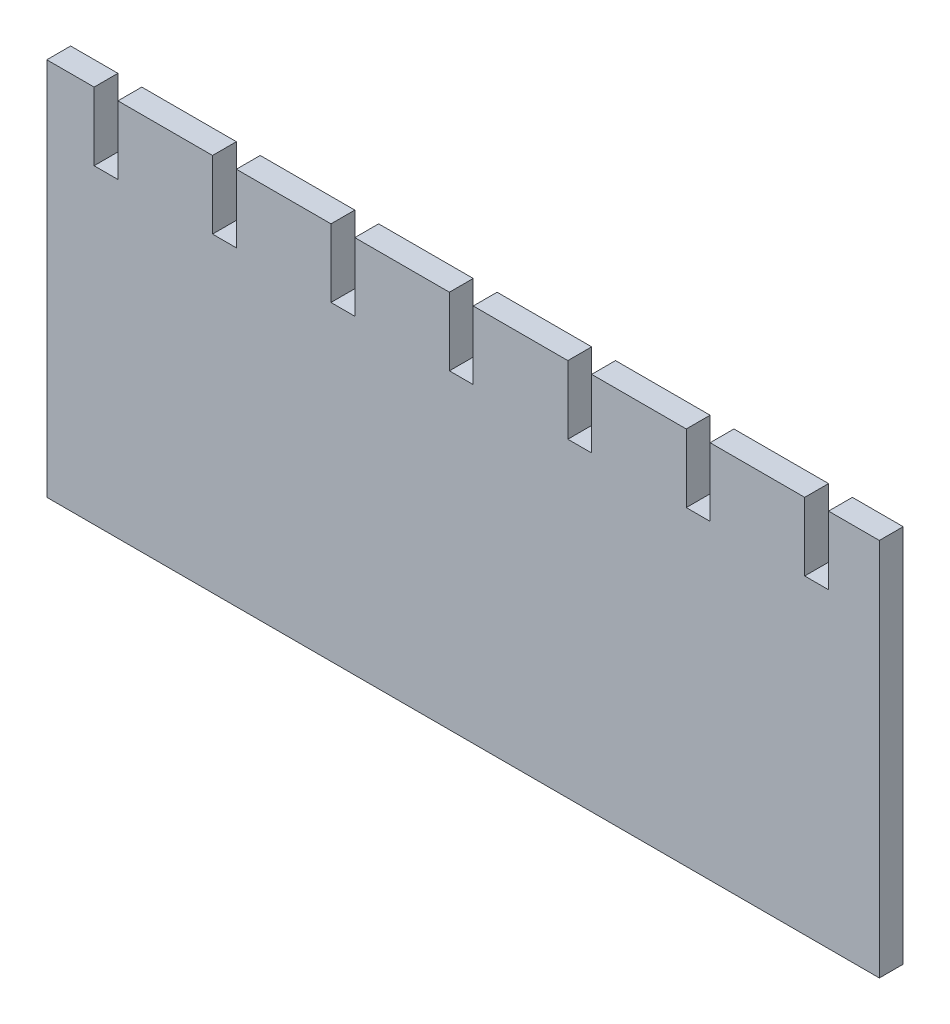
ISO-10303-21;
HEADER;
FILE_DESCRIPTION(('STEP AP214'),'2;1');
FILE_NAME('part.step','',(''),(''),'','','');
FILE_SCHEMA(('AUTOMOTIVE_DESIGN { 1 0 10303 214 1 1 1 1 }'));
ENDSEC;
DATA;
#1=APPLICATION_CONTEXT('core data for automotive mechanical design processes');
#2=APPLICATION_PROTOCOL_DEFINITION('international standard','automotive_design',2000,#1);
#3=PRODUCT_CONTEXT('',#1,'mechanical');
#4=PRODUCT('Part','Part','',(#3));
#5=PRODUCT_RELATED_PRODUCT_CATEGORY('part','',(#4));
#6=PRODUCT_DEFINITION_FORMATION('','',#4);
#7=PRODUCT_DEFINITION_CONTEXT('part definition',#1,'design');
#8=PRODUCT_DEFINITION('design','',#6,#7);
#9=PRODUCT_DEFINITION_SHAPE('','',#8);
#10=(LENGTH_UNIT() NAMED_UNIT(*) SI_UNIT(.MILLI.,.METRE.));
#11=(NAMED_UNIT(*) PLANE_ANGLE_UNIT() SI_UNIT($,.RADIAN.));
#12=(NAMED_UNIT(*) SI_UNIT($,.STERADIAN.) SOLID_ANGLE_UNIT());
#13=UNCERTAINTY_MEASURE_WITH_UNIT(LENGTH_MEASURE(1.E-05),#10,'distance_accuracy_value','');
#14=(GEOMETRIC_REPRESENTATION_CONTEXT(3) GLOBAL_UNCERTAINTY_ASSIGNED_CONTEXT((#13)) GLOBAL_UNIT_ASSIGNED_CONTEXT((#10,
#11,#12)) REPRESENTATION_CONTEXT('',''));
#15=CARTESIAN_POINT('',(0.,0.,0.));
#16=DIRECTION('',(0.,0.,1.));
#17=DIRECTION('',(1.,0.,0.));
#18=AXIS2_PLACEMENT_3D('',#15,#16,#17);
#19=CARTESIAN_POINT('',(-228.601896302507,165.29206567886,16.002));
#20=DIRECTION('',(0.,-1.,0.));
#21=DIRECTION('',(0.,0.,-1.));
#22=AXIS2_PLACEMENT_3D('',#19,#20,#21);
#23=PLANE('',#22);
#24=DIRECTION('',(-1.,0.,0.));
#25=VECTOR('',#24,1.);
#26=CARTESIAN_POINT('',(-228.601896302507,165.29206567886,0.));
#27=LINE('',#26,#25);
#28=CARTESIAN_POINT('',(-228.601896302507,165.29206567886,0.));
#29=VERTEX_POINT('',#28);
#30=CARTESIAN_POINT('',(-260.351896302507,165.29206567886,0.));
#31=VERTEX_POINT('',#30);
#32=EDGE_CURVE('E273',#29,#31,#27,.T.);
#33=ORIENTED_EDGE('',*,*,#32,.T.);
#34=DIRECTION('',(0.,0.,-1.));
#35=VECTOR('',#34,1.);
#36=CARTESIAN_POINT('',(-260.351896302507,165.29206567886,16.002));
#37=LINE('',#36,#35);
#38=CARTESIAN_POINT('',(-260.351896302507,165.29206567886,16.002));
#39=VERTEX_POINT('',#38);
#40=EDGE_CURVE('E11',#39,#31,#37,.T.);
#41=ORIENTED_EDGE('',*,*,#40,.F.);
#42=DIRECTION('',(-1.,0.,0.));
#43=VECTOR('',#42,1.);
#44=CARTESIAN_POINT('',(-228.601896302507,165.29206567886,16.002));
#45=LINE('',#44,#43);
#46=CARTESIAN_POINT('',(-228.601896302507,165.29206567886,16.002));
#47=VERTEX_POINT('',#46);
#48=EDGE_CURVE('E335',#47,#39,#45,.T.);
#49=ORIENTED_EDGE('',*,*,#48,.F.);
#50=DIRECTION('',(0.,0.,-1.));
#51=VECTOR('',#50,1.);
#52=CARTESIAN_POINT('',(-228.601896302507,165.29206567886,16.002));
#53=LINE('',#52,#51);
#54=EDGE_CURVE('E269',#47,#29,#53,.T.);
#55=ORIENTED_EDGE('',*,*,#54,.T.);
#56=EDGE_LOOP('',(#33,#41,#49,#55));
#57=FACE_BOUND('',#56,.T.);
#58=ADVANCED_FACE('F33',(#57),#23,.F.);
#59=CARTESIAN_POINT('',(-260.351896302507,-89.0805979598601,16.002));
#60=DIRECTION('',(1.,0.,0.));
#61=DIRECTION('',(0.,0.,-1.));
#62=AXIS2_PLACEMENT_3D('',#59,#60,#61);
#63=PLANE('',#62);
#64=DIRECTION('',(0.,-1.,0.));
#65=VECTOR('',#64,1.);
#66=CARTESIAN_POINT('',(-260.351896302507,-89.0805979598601,0.));
#67=LINE('',#66,#65);
#68=CARTESIAN_POINT('',(-260.351896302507,-89.0805979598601,0.));
#69=VERTEX_POINT('',#68);
#70=EDGE_CURVE('E276',#31,#69,#67,.T.);
#71=ORIENTED_EDGE('',*,*,#70,.T.);
#72=DIRECTION('',(0.,0.,-1.));
#73=VECTOR('',#72,1.);
#74=CARTESIAN_POINT('',(-260.351896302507,-89.0805979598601,16.002));
#75=LINE('',#74,#73);
#76=CARTESIAN_POINT('',(-260.351896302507,-89.0805979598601,16.002));
#77=VERTEX_POINT('',#76);
#78=EDGE_CURVE('E41',#77,#69,#75,.T.);
#79=ORIENTED_EDGE('',*,*,#78,.F.);
#80=DIRECTION('',(0.,-1.,0.));
#81=VECTOR('',#80,1.);
#82=CARTESIAN_POINT('',(-260.351896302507,-89.0805979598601,16.002));
#83=LINE('',#82,#81);
#84=EDGE_CURVE('E164',#39,#77,#83,.T.);
#85=ORIENTED_EDGE('',*,*,#84,.F.);
#86=ORIENTED_EDGE('',*,*,#40,.T.);
#87=EDGE_LOOP('',(#71,#79,#85,#86));
#88=FACE_BOUND('',#87,.T.);
#89=ADVANCED_FACE('F513',(#88),#63,.F.);
#90=CARTESIAN_POINT('',(-260.351896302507,-89.0805979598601,16.002));
#91=DIRECTION('',(0.,1.,0.));
#92=DIRECTION('',(0.,0.,1.));
#93=AXIS2_PLACEMENT_3D('',#90,#91,#92);
#94=PLANE('',#93);
#95=DIRECTION('',(1.,0.,0.));
#96=VECTOR('',#95,1.);
#97=CARTESIAN_POINT('',(-260.351896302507,-89.0805979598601,0.));
#98=LINE('',#97,#96);
#99=CARTESIAN_POINT('',(298.517953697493,-89.0805979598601,0.));
#100=VERTEX_POINT('',#99);
#101=EDGE_CURVE('E278',#69,#100,#98,.T.);
#102=ORIENTED_EDGE('',*,*,#101,.T.);
#103=DIRECTION('',(0.,0.,-1.));
#104=VECTOR('',#103,1.);
#105=CARTESIAN_POINT('',(298.517953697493,-89.0805979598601,16.002));
#106=LINE('',#105,#104);
#107=CARTESIAN_POINT('',(298.517953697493,-89.0805979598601,16.002));
#108=VERTEX_POINT('',#107);
#109=EDGE_CURVE('E414',#108,#100,#106,.T.);
#110=ORIENTED_EDGE('',*,*,#109,.F.);
#111=DIRECTION('',(1.,0.,0.));
#112=VECTOR('',#111,1.);
#113=CARTESIAN_POINT('',(-260.351896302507,-89.0805979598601,16.002));
#114=LINE('',#113,#112);
#115=EDGE_CURVE('E422',#77,#108,#114,.T.);
#116=ORIENTED_EDGE('',*,*,#115,.F.);
#117=ORIENTED_EDGE('',*,*,#78,.T.);
#118=EDGE_LOOP('',(#102,#110,#116,#117));
#119=FACE_BOUND('',#118,.T.);
#120=ADVANCED_FACE('F420',(#119),#94,.F.);
#121=CARTESIAN_POINT('',(298.517953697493,-89.0805979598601,16.002));
#122=DIRECTION('',(-1.,0.,0.));
#123=DIRECTION('',(0.,0.,1.));
#124=AXIS2_PLACEMENT_3D('',#121,#122,#123);
#125=PLANE('',#124);
#126=DIRECTION('',(0.,1.,0.));
#127=VECTOR('',#126,1.);
#128=CARTESIAN_POINT('',(298.517953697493,-89.0805979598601,0.));
#129=LINE('',#128,#127);
#130=CARTESIAN_POINT('',(298.517953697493,165.29206567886,0.));
#131=VERTEX_POINT('',#130);
#132=EDGE_CURVE('E280',#100,#131,#129,.T.);
#133=ORIENTED_EDGE('',*,*,#132,.T.);
#134=DIRECTION('',(0.,0.,-1.));
#135=VECTOR('',#134,1.);
#136=CARTESIAN_POINT('',(298.517953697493,165.29206567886,16.002));
#137=LINE('',#136,#135);
#138=CARTESIAN_POINT('',(298.517953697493,165.29206567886,16.002));
#139=VERTEX_POINT('',#138);
#140=EDGE_CURVE('E411',#139,#131,#137,.T.);
#141=ORIENTED_EDGE('',*,*,#140,.F.);
#142=DIRECTION('',(0.,1.,0.));
#143=VECTOR('',#142,1.);
#144=CARTESIAN_POINT('',(298.517953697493,-89.0805979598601,16.002));
#145=LINE('',#144,#143);
#146=EDGE_CURVE('E440',#108,#139,#145,.T.);
#147=ORIENTED_EDGE('',*,*,#146,.F.);
#148=ORIENTED_EDGE('',*,*,#109,.T.);
#149=EDGE_LOOP('',(#133,#141,#147,#148));
#150=FACE_BOUND('',#149,.T.);
#151=ADVANCED_FACE('F431',(#150),#125,.F.);
#152=CARTESIAN_POINT('',(264.406083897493,165.29206567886,16.002));
#153=DIRECTION('',(0.,-1.,0.));
#154=DIRECTION('',(1.,0.,0.));
#155=AXIS2_PLACEMENT_3D('',#152,#153,#154);
#156=PLANE('',#155);
#157=DIRECTION('',(-1.,0.,0.));
#158=VECTOR('',#157,1.);
#159=CARTESIAN_POINT('',(264.406083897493,165.29206567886,0.));
#160=LINE('',#159,#158);
#161=CARTESIAN_POINT('',(264.406083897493,165.29206567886,0.));
#162=VERTEX_POINT('',#161);
#163=EDGE_CURVE('E282',#131,#162,#160,.T.);
#164=ORIENTED_EDGE('',*,*,#163,.T.);
#165=DIRECTION('',(0.,0.,-1.));
#166=VECTOR('',#165,1.);
#167=CARTESIAN_POINT('',(264.406083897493,165.29206567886,16.002));
#168=LINE('',#167,#166);
#169=CARTESIAN_POINT('',(264.406083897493,165.29206567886,16.002));
#170=VERTEX_POINT('',#169);
#171=EDGE_CURVE('E408',#170,#162,#168,.T.);
#172=ORIENTED_EDGE('',*,*,#171,.F.);
#173=DIRECTION('',(-1.,0.,0.));
#174=VECTOR('',#173,1.);
#175=CARTESIAN_POINT('',(264.406083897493,165.29206567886,16.002));
#176=LINE('',#175,#174);
#177=EDGE_CURVE('E437',#139,#170,#176,.T.);
#178=ORIENTED_EDGE('',*,*,#177,.F.);
#179=ORIENTED_EDGE('',*,*,#140,.T.);
#180=EDGE_LOOP('',(#164,#172,#178,#179));
#181=FACE_BOUND('',#180,.T.);
#182=ADVANCED_FACE('F435',(#181),#156,.F.);
#183=CARTESIAN_POINT('',(264.406083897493,119.57208453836,16.002));
#184=DIRECTION('',(1.,0.,0.));
#185=DIRECTION('',(0.,0.,-1.));
#186=AXIS2_PLACEMENT_3D('',#183,#184,#185);
#187=PLANE('',#186);
#188=DIRECTION('',(0.,-1.,0.));
#189=VECTOR('',#188,1.);
#190=CARTESIAN_POINT('',(264.406083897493,119.57208453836,0.));
#191=LINE('',#190,#189);
#192=CARTESIAN_POINT('',(264.406083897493,119.57208453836,0.));
#193=VERTEX_POINT('',#192);
#194=EDGE_CURVE('E284',#162,#193,#191,.T.);
#195=ORIENTED_EDGE('',*,*,#194,.T.);
#196=DIRECTION('',(0.,0.,-1.));
#197=VECTOR('',#196,1.);
#198=CARTESIAN_POINT('',(264.406083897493,119.57208453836,16.002));
#199=LINE('',#198,#197);
#200=CARTESIAN_POINT('',(264.406083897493,119.57208453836,16.002));
#201=VERTEX_POINT('',#200);
#202=EDGE_CURVE('E405',#201,#193,#199,.T.);
#203=ORIENTED_EDGE('',*,*,#202,.F.);
#204=DIRECTION('',(0.,-1.,0.));
#205=VECTOR('',#204,1.);
#206=CARTESIAN_POINT('',(264.406083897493,119.57208453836,16.002));
#207=LINE('',#206,#205);
#208=EDGE_CURVE('E439',#170,#201,#207,.T.);
#209=ORIENTED_EDGE('',*,*,#208,.F.);
#210=ORIENTED_EDGE('',*,*,#171,.T.);
#211=EDGE_LOOP('',(#195,#203,#209,#210));
#212=FACE_BOUND('',#211,.T.);
#213=ADVANCED_FACE('F526',(#212),#187,.F.);
#214=CARTESIAN_POINT('',(248.404083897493,119.57208453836,16.002));
#215=DIRECTION('',(0.,-1.,0.));
#216=DIRECTION('',(0.,0.,-1.));
#217=AXIS2_PLACEMENT_3D('',#214,#215,#216);
#218=PLANE('',#217);
#219=DIRECTION('',(-1.,0.,0.));
#220=VECTOR('',#219,1.);
#221=CARTESIAN_POINT('',(248.404083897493,119.57208453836,0.));
#222=LINE('',#221,#220);
#223=CARTESIAN_POINT('',(248.404083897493,119.57208453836,0.));
#224=VERTEX_POINT('',#223);
#225=EDGE_CURVE('E286',#193,#224,#222,.T.);
#226=ORIENTED_EDGE('',*,*,#225,.T.);
#227=DIRECTION('',(0.,0.,-1.));
#228=VECTOR('',#227,1.);
#229=CARTESIAN_POINT('',(248.404083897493,119.57208453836,16.002));
#230=LINE('',#229,#228);
#231=CARTESIAN_POINT('',(248.404083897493,119.57208453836,16.002));
#232=VERTEX_POINT('',#231);
#233=EDGE_CURVE('E402',#232,#224,#230,.T.);
#234=ORIENTED_EDGE('',*,*,#233,.F.);
#235=DIRECTION('',(-1.,0.,0.));
#236=VECTOR('',#235,1.);
#237=CARTESIAN_POINT('',(248.404083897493,119.57208453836,16.002));
#238=LINE('',#237,#236);
#239=EDGE_CURVE('E442',#201,#232,#238,.T.);
#240=ORIENTED_EDGE('',*,*,#239,.F.);
#241=ORIENTED_EDGE('',*,*,#202,.T.);
#242=EDGE_LOOP('',(#226,#234,#240,#241));
#243=FACE_BOUND('',#242,.T.);
#244=ADVANCED_FACE('F529',(#243),#218,.F.);
#245=CARTESIAN_POINT('',(248.404083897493,165.29206567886,16.002));
#246=DIRECTION('',(-1.,0.,0.));
#247=DIRECTION('',(0.,0.,1.));
#248=AXIS2_PLACEMENT_3D('',#245,#246,#247);
#249=PLANE('',#248);
#250=DIRECTION('',(0.,1.,0.));
#251=VECTOR('',#250,1.);
#252=CARTESIAN_POINT('',(248.404083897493,165.29206567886,0.));
#253=LINE('',#252,#251);
#254=CARTESIAN_POINT('',(248.404083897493,165.29206567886,0.));
#255=VERTEX_POINT('',#254);
#256=EDGE_CURVE('E288',#224,#255,#253,.T.);
#257=ORIENTED_EDGE('',*,*,#256,.T.);
#258=DIRECTION('',(0.,0.,-1.));
#259=VECTOR('',#258,1.);
#260=CARTESIAN_POINT('',(248.404083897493,165.29206567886,16.002));
#261=LINE('',#260,#259);
#262=CARTESIAN_POINT('',(248.404083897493,165.29206567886,16.002));
#263=VERTEX_POINT('',#262);
#264=EDGE_CURVE('E399',#263,#255,#261,.T.);
#265=ORIENTED_EDGE('',*,*,#264,.F.);
#266=DIRECTION('',(0.,1.,0.));
#267=VECTOR('',#266,1.);
#268=CARTESIAN_POINT('',(248.404083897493,165.29206567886,16.002));
#269=LINE('',#268,#267);
#270=EDGE_CURVE('E448',#232,#263,#269,.T.);
#271=ORIENTED_EDGE('',*,*,#270,.F.);
#272=ORIENTED_EDGE('',*,*,#233,.T.);
#273=EDGE_LOOP('',(#257,#265,#271,#272));
#274=FACE_BOUND('',#273,.T.);
#275=ADVANCED_FACE('F533',(#274),#249,.F.);
#276=CARTESIAN_POINT('',(184.904083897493,165.29206567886,16.002));
#277=DIRECTION('',(0.,-1.,0.));
#278=DIRECTION('',(1.,0.,0.));
#279=AXIS2_PLACEMENT_3D('',#276,#277,#278);
#280=PLANE('',#279);
#281=DIRECTION('',(-1.,0.,0.));
#282=VECTOR('',#281,1.);
#283=CARTESIAN_POINT('',(184.904083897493,165.29206567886,0.));
#284=LINE('',#283,#282);
#285=CARTESIAN_POINT('',(184.904083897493,165.29206567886,0.));
#286=VERTEX_POINT('',#285);
#287=EDGE_CURVE('E290',#255,#286,#284,.T.);
#288=ORIENTED_EDGE('',*,*,#287,.T.);
#289=DIRECTION('',(0.,0.,-1.));
#290=VECTOR('',#289,1.);
#291=CARTESIAN_POINT('',(184.904083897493,165.29206567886,16.002));
#292=LINE('',#291,#290);
#293=CARTESIAN_POINT('',(184.904083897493,165.29206567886,16.002));
#294=VERTEX_POINT('',#293);
#295=EDGE_CURVE('E396',#294,#286,#292,.T.);
#296=ORIENTED_EDGE('',*,*,#295,.F.);
#297=DIRECTION('',(-1.,0.,0.));
#298=VECTOR('',#297,1.);
#299=CARTESIAN_POINT('',(184.904083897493,165.29206567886,16.002));
#300=LINE('',#299,#298);
#301=EDGE_CURVE('E450',#263,#294,#300,.T.);
#302=ORIENTED_EDGE('',*,*,#301,.F.);
#303=ORIENTED_EDGE('',*,*,#264,.T.);
#304=EDGE_LOOP('',(#288,#296,#302,#303));
#305=FACE_BOUND('',#304,.T.);
#306=ADVANCED_FACE('F537',(#305),#280,.F.);
#307=CARTESIAN_POINT('',(184.904083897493,119.57208453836,16.002));
#308=DIRECTION('',(1.,0.,0.));
#309=DIRECTION('',(0.,0.,-1.));
#310=AXIS2_PLACEMENT_3D('',#307,#308,#309);
#311=PLANE('',#310);
#312=DIRECTION('',(0.,-1.,0.));
#313=VECTOR('',#312,1.);
#314=CARTESIAN_POINT('',(184.904083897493,119.57208453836,0.));
#315=LINE('',#314,#313);
#316=CARTESIAN_POINT('',(184.904083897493,119.57208453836,0.));
#317=VERTEX_POINT('',#316);
#318=EDGE_CURVE('E292',#286,#317,#315,.T.);
#319=ORIENTED_EDGE('',*,*,#318,.T.);
#320=DIRECTION('',(0.,0.,-1.));
#321=VECTOR('',#320,1.);
#322=CARTESIAN_POINT('',(184.904083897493,119.57208453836,16.002));
#323=LINE('',#322,#321);
#324=CARTESIAN_POINT('',(184.904083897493,119.57208453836,16.002));
#325=VERTEX_POINT('',#324);
#326=EDGE_CURVE('E393',#325,#317,#323,.T.);
#327=ORIENTED_EDGE('',*,*,#326,.F.);
#328=DIRECTION('',(0.,-1.,0.));
#329=VECTOR('',#328,1.);
#330=CARTESIAN_POINT('',(184.904083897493,119.57208453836,16.002));
#331=LINE('',#330,#329);
#332=EDGE_CURVE('E452',#294,#325,#331,.T.);
#333=ORIENTED_EDGE('',*,*,#332,.F.);
#334=ORIENTED_EDGE('',*,*,#295,.T.);
#335=EDGE_LOOP('',(#319,#327,#333,#334));
#336=FACE_BOUND('',#335,.T.);
#337=ADVANCED_FACE('F541',(#336),#311,.F.);
#338=CARTESIAN_POINT('',(168.902083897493,119.57208453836,16.002));
#339=DIRECTION('',(0.,-1.,0.));
#340=DIRECTION('',(1.,0.,0.));
#341=AXIS2_PLACEMENT_3D('',#338,#339,#340);
#342=PLANE('',#341);
#343=DIRECTION('',(-1.,0.,0.));
#344=VECTOR('',#343,1.);
#345=CARTESIAN_POINT('',(168.902083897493,119.57208453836,0.));
#346=LINE('',#345,#344);
#347=CARTESIAN_POINT('',(168.902083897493,119.57208453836,0.));
#348=VERTEX_POINT('',#347);
#349=EDGE_CURVE('E294',#317,#348,#346,.T.);
#350=ORIENTED_EDGE('',*,*,#349,.T.);
#351=DIRECTION('',(0.,0.,-1.));
#352=VECTOR('',#351,1.);
#353=CARTESIAN_POINT('',(168.902083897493,119.57208453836,16.002));
#354=LINE('',#353,#352);
#355=CARTESIAN_POINT('',(168.902083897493,119.57208453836,16.002));
#356=VERTEX_POINT('',#355);
#357=EDGE_CURVE('E390',#356,#348,#354,.T.);
#358=ORIENTED_EDGE('',*,*,#357,.F.);
#359=DIRECTION('',(-1.,0.,0.));
#360=VECTOR('',#359,1.);
#361=CARTESIAN_POINT('',(168.902083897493,119.57208453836,16.002));
#362=LINE('',#361,#360);
#363=EDGE_CURVE('E454',#325,#356,#362,.T.);
#364=ORIENTED_EDGE('',*,*,#363,.F.);
#365=ORIENTED_EDGE('',*,*,#326,.T.);
#366=EDGE_LOOP('',(#350,#358,#364,#365));
#367=FACE_BOUND('',#366,.T.);
#368=ADVANCED_FACE('F545',(#367),#342,.F.);
#369=CARTESIAN_POINT('',(168.902083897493,165.29206567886,16.002));
#370=DIRECTION('',(-1.,0.,0.));
#371=DIRECTION('',(0.,0.,1.));
#372=AXIS2_PLACEMENT_3D('',#369,#370,#371);
#373=PLANE('',#372);
#374=DIRECTION('',(0.,1.,0.));
#375=VECTOR('',#374,1.);
#376=CARTESIAN_POINT('',(168.902083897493,165.29206567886,0.));
#377=LINE('',#376,#375);
#378=CARTESIAN_POINT('',(168.902083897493,165.29206567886,0.));
#379=VERTEX_POINT('',#378);
#380=EDGE_CURVE('E296',#348,#379,#377,.T.);
#381=ORIENTED_EDGE('',*,*,#380,.T.);
#382=DIRECTION('',(0.,0.,-1.));
#383=VECTOR('',#382,1.);
#384=CARTESIAN_POINT('',(168.902083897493,165.29206567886,16.002));
#385=LINE('',#384,#383);
#386=CARTESIAN_POINT('',(168.902083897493,165.29206567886,16.002));
#387=VERTEX_POINT('',#386);
#388=EDGE_CURVE('E387',#387,#379,#385,.T.);
#389=ORIENTED_EDGE('',*,*,#388,.F.);
#390=DIRECTION('',(0.,1.,0.));
#391=VECTOR('',#390,1.);
#392=CARTESIAN_POINT('',(168.902083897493,165.29206567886,16.002));
#393=LINE('',#392,#391);
#394=EDGE_CURVE('E456',#356,#387,#393,.T.);
#395=ORIENTED_EDGE('',*,*,#394,.F.);
#396=ORIENTED_EDGE('',*,*,#357,.T.);
#397=EDGE_LOOP('',(#381,#389,#395,#396));
#398=FACE_BOUND('',#397,.T.);
#399=ADVANCED_FACE('F549',(#398),#373,.F.);
#400=CARTESIAN_POINT('',(168.902083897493,165.29206567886,16.002));
#401=DIRECTION('',(0.,-1.,0.));
#402=DIRECTION('',(1.,0.,0.));
#403=AXIS2_PLACEMENT_3D('',#400,#401,#402);
#404=PLANE('',#403);
#405=DIRECTION('',(-1.,0.,0.));
#406=VECTOR('',#405,1.);
#407=CARTESIAN_POINT('',(168.902083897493,165.29206567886,0.));
#408=LINE('',#407,#406);
#409=CARTESIAN_POINT('',(105.402083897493,165.29206567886,0.));
#410=VERTEX_POINT('',#409);
#411=EDGE_CURVE('E298',#379,#410,#408,.T.);
#412=ORIENTED_EDGE('',*,*,#411,.T.);
#413=DIRECTION('',(0.,0.,-1.));
#414=VECTOR('',#413,1.);
#415=CARTESIAN_POINT('',(105.402083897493,165.29206567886,16.002));
#416=LINE('',#415,#414);
#417=CARTESIAN_POINT('',(105.402083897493,165.29206567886,16.002));
#418=VERTEX_POINT('',#417);
#419=EDGE_CURVE('E384',#418,#410,#416,.T.);
#420=ORIENTED_EDGE('',*,*,#419,.F.);
#421=DIRECTION('',(-1.,0.,0.));
#422=VECTOR('',#421,1.);
#423=CARTESIAN_POINT('',(168.902083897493,165.29206567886,16.002));
#424=LINE('',#423,#422);
#425=EDGE_CURVE('E458',#387,#418,#424,.T.);
#426=ORIENTED_EDGE('',*,*,#425,.F.);
#427=ORIENTED_EDGE('',*,*,#388,.T.);
#428=EDGE_LOOP('',(#412,#420,#426,#427));
#429=FACE_BOUND('',#428,.T.);
#430=ADVANCED_FACE('F553',(#429),#404,.F.);
#431=CARTESIAN_POINT('',(105.402083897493,165.29206567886,16.002));
#432=DIRECTION('',(1.,0.,0.));
#433=DIRECTION('',(0.,1.,0.));
#434=AXIS2_PLACEMENT_3D('',#431,#432,#433);
#435=PLANE('',#434);
#436=DIRECTION('',(0.,-1.,0.));
#437=VECTOR('',#436,1.);
#438=CARTESIAN_POINT('',(105.402083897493,165.29206567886,0.));
#439=LINE('',#438,#437);
#440=CARTESIAN_POINT('',(105.402083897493,119.57208453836,0.));
#441=VERTEX_POINT('',#440);
#442=EDGE_CURVE('E300',#410,#441,#439,.T.);
#443=ORIENTED_EDGE('',*,*,#442,.T.);
#444=DIRECTION('',(0.,0.,-1.));
#445=VECTOR('',#444,1.);
#446=CARTESIAN_POINT('',(105.402083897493,119.57208453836,16.002));
#447=LINE('',#446,#445);
#448=CARTESIAN_POINT('',(105.402083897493,119.57208453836,16.002));
#449=VERTEX_POINT('',#448);
#450=EDGE_CURVE('E381',#449,#441,#447,.T.);
#451=ORIENTED_EDGE('',*,*,#450,.F.);
#452=DIRECTION('',(0.,-1.,0.));
#453=VECTOR('',#452,1.);
#454=CARTESIAN_POINT('',(105.402083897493,165.29206567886,16.002));
#455=LINE('',#454,#453);
#456=EDGE_CURVE('E460',#418,#449,#455,.T.);
#457=ORIENTED_EDGE('',*,*,#456,.F.);
#458=ORIENTED_EDGE('',*,*,#419,.T.);
#459=EDGE_LOOP('',(#443,#451,#457,#458));
#460=FACE_BOUND('',#459,.T.);
#461=ADVANCED_FACE('F557',(#460),#435,.F.);
#462=CARTESIAN_POINT('',(89.4000838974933,119.57208453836,16.002));
#463=DIRECTION('',(0.,-1.,0.));
#464=DIRECTION('',(1.,0.,0.));
#465=AXIS2_PLACEMENT_3D('',#462,#463,#464);
#466=PLANE('',#465);
#467=DIRECTION('',(-1.,0.,0.));
#468=VECTOR('',#467,1.);
#469=CARTESIAN_POINT('',(89.4000838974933,119.57208453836,0.));
#470=LINE('',#469,#468);
#471=CARTESIAN_POINT('',(89.4000838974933,119.57208453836,0.));
#472=VERTEX_POINT('',#471);
#473=EDGE_CURVE('E302',#441,#472,#470,.T.);
#474=ORIENTED_EDGE('',*,*,#473,.T.);
#475=DIRECTION('',(0.,0.,-1.));
#476=VECTOR('',#475,1.);
#477=CARTESIAN_POINT('',(89.4000838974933,119.57208453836,16.002));
#478=LINE('',#477,#476);
#479=CARTESIAN_POINT('',(89.4000838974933,119.57208453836,16.002));
#480=VERTEX_POINT('',#479);
#481=EDGE_CURVE('E378',#480,#472,#478,.T.);
#482=ORIENTED_EDGE('',*,*,#481,.F.);
#483=DIRECTION('',(-1.,0.,0.));
#484=VECTOR('',#483,1.);
#485=CARTESIAN_POINT('',(89.4000838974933,119.57208453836,16.002));
#486=LINE('',#485,#484);
#487=EDGE_CURVE('E462',#449,#480,#486,.T.);
#488=ORIENTED_EDGE('',*,*,#487,.F.);
#489=ORIENTED_EDGE('',*,*,#450,.T.);
#490=EDGE_LOOP('',(#474,#482,#488,#489));
#491=FACE_BOUND('',#490,.T.);
#492=ADVANCED_FACE('F561',(#491),#466,.F.);
#493=CARTESIAN_POINT('',(89.4000838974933,165.29206567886,16.002));
#494=DIRECTION('',(-1.,0.,0.));
#495=DIRECTION('',(0.,-1.,0.));
#496=AXIS2_PLACEMENT_3D('',#493,#494,#495);
#497=PLANE('',#496);
#498=DIRECTION('',(0.,1.,0.));
#499=VECTOR('',#498,1.);
#500=CARTESIAN_POINT('',(89.4000838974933,165.29206567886,0.));
#501=LINE('',#500,#499);
#502=CARTESIAN_POINT('',(89.4000838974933,165.29206567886,0.));
#503=VERTEX_POINT('',#502);
#504=EDGE_CURVE('E304',#472,#503,#501,.T.);
#505=ORIENTED_EDGE('',*,*,#504,.T.);
#506=DIRECTION('',(0.,0.,-1.));
#507=VECTOR('',#506,1.);
#508=CARTESIAN_POINT('',(89.4000838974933,165.29206567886,16.002));
#509=LINE('',#508,#507);
#510=CARTESIAN_POINT('',(89.4000838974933,165.29206567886,16.002));
#511=VERTEX_POINT('',#510);
#512=EDGE_CURVE('E375',#511,#503,#509,.T.);
#513=ORIENTED_EDGE('',*,*,#512,.F.);
#514=DIRECTION('',(0.,1.,0.));
#515=VECTOR('',#514,1.);
#516=CARTESIAN_POINT('',(89.4000838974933,165.29206567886,16.002));
#517=LINE('',#516,#515);
#518=EDGE_CURVE('E464',#480,#511,#517,.T.);
#519=ORIENTED_EDGE('',*,*,#518,.F.);
#520=ORIENTED_EDGE('',*,*,#481,.T.);
#521=EDGE_LOOP('',(#505,#513,#519,#520));
#522=FACE_BOUND('',#521,.T.);
#523=ADVANCED_FACE('F565',(#522),#497,.F.);
#524=CARTESIAN_POINT('',(25.9000838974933,165.29206567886,16.002));
#525=DIRECTION('',(0.,-1.,0.));
#526=DIRECTION('',(1.,0.,0.));
#527=AXIS2_PLACEMENT_3D('',#524,#525,#526);
#528=PLANE('',#527);
#529=DIRECTION('',(-1.,0.,0.));
#530=VECTOR('',#529,1.);
#531=CARTESIAN_POINT('',(25.9000838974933,165.29206567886,0.));
#532=LINE('',#531,#530);
#533=CARTESIAN_POINT('',(25.9000838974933,165.29206567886,0.));
#534=VERTEX_POINT('',#533);
#535=EDGE_CURVE('E306',#503,#534,#532,.T.);
#536=ORIENTED_EDGE('',*,*,#535,.T.);
#537=DIRECTION('',(0.,0.,-1.));
#538=VECTOR('',#537,1.);
#539=CARTESIAN_POINT('',(25.9000838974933,165.29206567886,16.002));
#540=LINE('',#539,#538);
#541=CARTESIAN_POINT('',(25.9000838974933,165.29206567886,16.002));
#542=VERTEX_POINT('',#541);
#543=EDGE_CURVE('E372',#542,#534,#540,.T.);
#544=ORIENTED_EDGE('',*,*,#543,.F.);
#545=DIRECTION('',(-1.,0.,0.));
#546=VECTOR('',#545,1.);
#547=CARTESIAN_POINT('',(25.9000838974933,165.29206567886,16.002));
#548=LINE('',#547,#546);
#549=EDGE_CURVE('E466',#511,#542,#548,.T.);
#550=ORIENTED_EDGE('',*,*,#549,.F.);
#551=ORIENTED_EDGE('',*,*,#512,.T.);
#552=EDGE_LOOP('',(#536,#544,#550,#551));
#553=FACE_BOUND('',#552,.T.);
#554=ADVANCED_FACE('F569',(#553),#528,.F.);
#555=CARTESIAN_POINT('',(25.9000838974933,119.57208453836,16.002));
#556=DIRECTION('',(1.,0.,0.));
#557=DIRECTION('',(0.,1.,0.));
#558=AXIS2_PLACEMENT_3D('',#555,#556,#557);
#559=PLANE('',#558);
#560=DIRECTION('',(0.,-1.,0.));
#561=VECTOR('',#560,1.);
#562=CARTESIAN_POINT('',(25.9000838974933,119.57208453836,0.));
#563=LINE('',#562,#561);
#564=CARTESIAN_POINT('',(25.9000838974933,119.57208453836,0.));
#565=VERTEX_POINT('',#564);
#566=EDGE_CURVE('E308',#534,#565,#563,.T.);
#567=ORIENTED_EDGE('',*,*,#566,.T.);
#568=DIRECTION('',(0.,0.,-1.));
#569=VECTOR('',#568,1.);
#570=CARTESIAN_POINT('',(25.9000838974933,119.57208453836,16.002));
#571=LINE('',#570,#569);
#572=CARTESIAN_POINT('',(25.9000838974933,119.57208453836,16.002));
#573=VERTEX_POINT('',#572);
#574=EDGE_CURVE('E369',#573,#565,#571,.T.);
#575=ORIENTED_EDGE('',*,*,#574,.F.);
#576=DIRECTION('',(0.,-1.,0.));
#577=VECTOR('',#576,1.);
#578=CARTESIAN_POINT('',(25.9000838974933,119.57208453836,16.002));
#579=LINE('',#578,#577);
#580=EDGE_CURVE('E468',#542,#573,#579,.T.);
#581=ORIENTED_EDGE('',*,*,#580,.F.);
#582=ORIENTED_EDGE('',*,*,#543,.T.);
#583=EDGE_LOOP('',(#567,#575,#581,#582));
#584=FACE_BOUND('',#583,.T.);
#585=ADVANCED_FACE('F573',(#584),#559,.F.);
#586=CARTESIAN_POINT('',(9.90009049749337,119.57208453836,16.002));
#587=DIRECTION('',(0.,-1.,0.));
#588=DIRECTION('',(1.,0.,0.));
#589=AXIS2_PLACEMENT_3D('',#586,#587,#588);
#590=PLANE('',#589);
#591=DIRECTION('',(-1.,0.,0.));
#592=VECTOR('',#591,1.);
#593=CARTESIAN_POINT('',(9.90009049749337,119.57208453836,0.));
#594=LINE('',#593,#592);
#595=CARTESIAN_POINT('',(9.90009049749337,119.57208453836,0.));
#596=VERTEX_POINT('',#595);
#597=EDGE_CURVE('E310',#565,#596,#594,.T.);
#598=ORIENTED_EDGE('',*,*,#597,.T.);
#599=DIRECTION('',(0.,0.,-1.));
#600=VECTOR('',#599,1.);
#601=CARTESIAN_POINT('',(9.90009049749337,119.57208453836,16.002));
#602=LINE('',#601,#600);
#603=CARTESIAN_POINT('',(9.90009049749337,119.57208453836,16.002));
#604=VERTEX_POINT('',#603);
#605=EDGE_CURVE('E366',#604,#596,#602,.T.);
#606=ORIENTED_EDGE('',*,*,#605,.F.);
#607=DIRECTION('',(-1.,0.,0.));
#608=VECTOR('',#607,1.);
#609=CARTESIAN_POINT('',(9.90009049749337,119.57208453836,16.002));
#610=LINE('',#609,#608);
#611=EDGE_CURVE('E470',#573,#604,#610,.T.);
#612=ORIENTED_EDGE('',*,*,#611,.F.);
#613=ORIENTED_EDGE('',*,*,#574,.T.);
#614=EDGE_LOOP('',(#598,#606,#612,#613));
#615=FACE_BOUND('',#614,.T.);
#616=ADVANCED_FACE('F577',(#615),#590,.F.);
#617=CARTESIAN_POINT('',(9.90009049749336,165.29206567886,16.002));
#618=DIRECTION('',(-1.,0.,0.));
#619=DIRECTION('',(0.,-1.,0.));
#620=AXIS2_PLACEMENT_3D('',#617,#618,#619);
#621=PLANE('',#620);
#622=DIRECTION('',(0.,1.,0.));
#623=VECTOR('',#622,1.);
#624=CARTESIAN_POINT('',(9.90009049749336,165.29206567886,0.));
#625=LINE('',#624,#623);
#626=CARTESIAN_POINT('',(9.90009049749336,165.29206567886,0.));
#627=VERTEX_POINT('',#626);
#628=EDGE_CURVE('E312',#596,#627,#625,.T.);
#629=ORIENTED_EDGE('',*,*,#628,.T.);
#630=DIRECTION('',(0.,0.,-1.));
#631=VECTOR('',#630,1.);
#632=CARTESIAN_POINT('',(9.90009049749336,165.29206567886,16.002));
#633=LINE('',#632,#631);
#634=CARTESIAN_POINT('',(9.90009049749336,165.29206567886,16.002));
#635=VERTEX_POINT('',#634);
#636=EDGE_CURVE('E363',#635,#627,#633,.T.);
#637=ORIENTED_EDGE('',*,*,#636,.F.);
#638=DIRECTION('',(0.,1.,0.));
#639=VECTOR('',#638,1.);
#640=CARTESIAN_POINT('',(9.90009049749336,165.29206567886,16.002));
#641=LINE('',#640,#639);
#642=EDGE_CURVE('E472',#604,#635,#641,.T.);
#643=ORIENTED_EDGE('',*,*,#642,.F.);
#644=ORIENTED_EDGE('',*,*,#605,.T.);
#645=EDGE_LOOP('',(#629,#637,#643,#644));
#646=FACE_BOUND('',#645,.T.);
#647=ADVANCED_FACE('F581',(#646),#621,.F.);
#648=CARTESIAN_POINT('',(-53.5999095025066,165.29206567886,16.002));
#649=DIRECTION('',(0.,-1.,0.));
#650=DIRECTION('',(1.,0.,0.));
#651=AXIS2_PLACEMENT_3D('',#648,#649,#650);
#652=PLANE('',#651);
#653=DIRECTION('',(-1.,0.,0.));
#654=VECTOR('',#653,1.);
#655=CARTESIAN_POINT('',(-53.5999095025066,165.29206567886,0.));
#656=LINE('',#655,#654);
#657=CARTESIAN_POINT('',(-53.5999095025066,165.29206567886,0.));
#658=VERTEX_POINT('',#657);
#659=EDGE_CURVE('E314',#627,#658,#656,.T.);
#660=ORIENTED_EDGE('',*,*,#659,.T.);
#661=DIRECTION('',(0.,0.,-1.));
#662=VECTOR('',#661,1.);
#663=CARTESIAN_POINT('',(-53.5999095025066,165.29206567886,16.002));
#664=LINE('',#663,#662);
#665=CARTESIAN_POINT('',(-53.5999095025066,165.29206567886,16.002));
#666=VERTEX_POINT('',#665);
#667=EDGE_CURVE('E360',#666,#658,#664,.T.);
#668=ORIENTED_EDGE('',*,*,#667,.F.);
#669=DIRECTION('',(-1.,0.,0.));
#670=VECTOR('',#669,1.);
#671=CARTESIAN_POINT('',(-53.5999095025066,165.29206567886,16.002));
#672=LINE('',#671,#670);
#673=EDGE_CURVE('E474',#635,#666,#672,.T.);
#674=ORIENTED_EDGE('',*,*,#673,.F.);
#675=ORIENTED_EDGE('',*,*,#636,.T.);
#676=EDGE_LOOP('',(#660,#668,#674,#675));
#677=FACE_BOUND('',#676,.T.);
#678=ADVANCED_FACE('F585',(#677),#652,.F.);
#679=CARTESIAN_POINT('',(-53.5999095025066,119.57208453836,16.002));
#680=DIRECTION('',(1.,0.,0.));
#681=DIRECTION('',(0.,1.,0.));
#682=AXIS2_PLACEMENT_3D('',#679,#680,#681);
#683=PLANE('',#682);
#684=DIRECTION('',(0.,-1.,0.));
#685=VECTOR('',#684,1.);
#686=CARTESIAN_POINT('',(-53.5999095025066,119.57208453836,0.));
#687=LINE('',#686,#685);
#688=CARTESIAN_POINT('',(-53.5999095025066,119.57208453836,0.));
#689=VERTEX_POINT('',#688);
#690=EDGE_CURVE('E316',#658,#689,#687,.T.);
#691=ORIENTED_EDGE('',*,*,#690,.T.);
#692=DIRECTION('',(0.,0.,-1.));
#693=VECTOR('',#692,1.);
#694=CARTESIAN_POINT('',(-53.5999095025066,119.57208453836,16.002));
#695=LINE('',#694,#693);
#696=CARTESIAN_POINT('',(-53.5999095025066,119.57208453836,16.002));
#697=VERTEX_POINT('',#696);
#698=EDGE_CURVE('E357',#697,#689,#695,.T.);
#699=ORIENTED_EDGE('',*,*,#698,.F.);
#700=DIRECTION('',(0.,-1.,0.));
#701=VECTOR('',#700,1.);
#702=CARTESIAN_POINT('',(-53.5999095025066,119.57208453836,16.002));
#703=LINE('',#702,#701);
#704=EDGE_CURVE('E476',#666,#697,#703,.T.);
#705=ORIENTED_EDGE('',*,*,#704,.F.);
#706=ORIENTED_EDGE('',*,*,#667,.T.);
#707=EDGE_LOOP('',(#691,#699,#705,#706));
#708=FACE_BOUND('',#707,.T.);
#709=ADVANCED_FACE('F589',(#708),#683,.F.);
#710=CARTESIAN_POINT('',(-69.5999029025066,119.57208453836,16.002));
#711=DIRECTION('',(0.,-1.,0.));
#712=DIRECTION('',(0.,0.,-1.));
#713=AXIS2_PLACEMENT_3D('',#710,#711,#712);
#714=PLANE('',#713);
#715=DIRECTION('',(-1.,0.,0.));
#716=VECTOR('',#715,1.);
#717=CARTESIAN_POINT('',(-69.5999029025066,119.57208453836,0.));
#718=LINE('',#717,#716);
#719=CARTESIAN_POINT('',(-69.5999029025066,119.57208453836,0.));
#720=VERTEX_POINT('',#719);
#721=EDGE_CURVE('E318',#689,#720,#718,.T.);
#722=ORIENTED_EDGE('',*,*,#721,.T.);
#723=DIRECTION('',(0.,0.,-1.));
#724=VECTOR('',#723,1.);
#725=CARTESIAN_POINT('',(-69.5999029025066,119.57208453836,16.002));
#726=LINE('',#725,#724);
#727=CARTESIAN_POINT('',(-69.5999029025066,119.57208453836,16.002));
#728=VERTEX_POINT('',#727);
#729=EDGE_CURVE('E354',#728,#720,#726,.T.);
#730=ORIENTED_EDGE('',*,*,#729,.F.);
#731=DIRECTION('',(-1.,0.,0.));
#732=VECTOR('',#731,1.);
#733=CARTESIAN_POINT('',(-69.5999029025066,119.57208453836,16.002));
#734=LINE('',#733,#732);
#735=EDGE_CURVE('E478',#697,#728,#734,.T.);
#736=ORIENTED_EDGE('',*,*,#735,.F.);
#737=ORIENTED_EDGE('',*,*,#698,.T.);
#738=EDGE_LOOP('',(#722,#730,#736,#737));
#739=FACE_BOUND('',#738,.T.);
#740=ADVANCED_FACE('F593',(#739),#714,.F.);
#741=CARTESIAN_POINT('',(-69.5999029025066,165.29206567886,16.002));
#742=DIRECTION('',(-1.,0.,0.));
#743=DIRECTION('',(0.,0.,1.));
#744=AXIS2_PLACEMENT_3D('',#741,#742,#743);
#745=PLANE('',#744);
#746=DIRECTION('',(0.,1.,0.));
#747=VECTOR('',#746,1.);
#748=CARTESIAN_POINT('',(-69.5999029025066,165.29206567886,0.));
#749=LINE('',#748,#747);
#750=CARTESIAN_POINT('',(-69.5999029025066,165.29206567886,0.));
#751=VERTEX_POINT('',#750);
#752=EDGE_CURVE('E320',#720,#751,#749,.T.);
#753=ORIENTED_EDGE('',*,*,#752,.T.);
#754=DIRECTION('',(0.,0.,-1.));
#755=VECTOR('',#754,1.);
#756=CARTESIAN_POINT('',(-69.5999029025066,165.29206567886,16.002));
#757=LINE('',#756,#755);
#758=CARTESIAN_POINT('',(-69.5999029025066,165.29206567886,16.002));
#759=VERTEX_POINT('',#758);
#760=EDGE_CURVE('E351',#759,#751,#757,.T.);
#761=ORIENTED_EDGE('',*,*,#760,.F.);
#762=DIRECTION('',(0.,1.,0.));
#763=VECTOR('',#762,1.);
#764=CARTESIAN_POINT('',(-69.5999029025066,165.29206567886,16.002));
#765=LINE('',#764,#763);
#766=EDGE_CURVE('E480',#728,#759,#765,.T.);
#767=ORIENTED_EDGE('',*,*,#766,.F.);
#768=ORIENTED_EDGE('',*,*,#729,.T.);
#769=EDGE_LOOP('',(#753,#761,#767,#768));
#770=FACE_BOUND('',#769,.T.);
#771=ADVANCED_FACE('F597',(#770),#745,.F.);
#772=CARTESIAN_POINT('',(-133.099902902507,165.29206567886,16.002));
#773=DIRECTION('',(0.,-1.,0.));
#774=DIRECTION('',(1.,0.,0.));
#775=AXIS2_PLACEMENT_3D('',#772,#773,#774);
#776=PLANE('',#775);
#777=DIRECTION('',(-1.,0.,0.));
#778=VECTOR('',#777,1.);
#779=CARTESIAN_POINT('',(-133.099902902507,165.29206567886,0.));
#780=LINE('',#779,#778);
#781=CARTESIAN_POINT('',(-133.099902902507,165.29206567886,0.));
#782=VERTEX_POINT('',#781);
#783=EDGE_CURVE('E322',#751,#782,#780,.T.);
#784=ORIENTED_EDGE('',*,*,#783,.T.);
#785=DIRECTION('',(0.,0.,-1.));
#786=VECTOR('',#785,1.);
#787=CARTESIAN_POINT('',(-133.099902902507,165.29206567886,16.002));
#788=LINE('',#787,#786);
#789=CARTESIAN_POINT('',(-133.099902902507,165.29206567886,16.002));
#790=VERTEX_POINT('',#789);
#791=EDGE_CURVE('E348',#790,#782,#788,.T.);
#792=ORIENTED_EDGE('',*,*,#791,.F.);
#793=DIRECTION('',(-1.,0.,0.));
#794=VECTOR('',#793,1.);
#795=CARTESIAN_POINT('',(-133.099902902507,165.29206567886,16.002));
#796=LINE('',#795,#794);
#797=EDGE_CURVE('E482',#759,#790,#796,.T.);
#798=ORIENTED_EDGE('',*,*,#797,.F.);
#799=ORIENTED_EDGE('',*,*,#760,.T.);
#800=EDGE_LOOP('',(#784,#792,#798,#799));
#801=FACE_BOUND('',#800,.T.);
#802=ADVANCED_FACE('F601',(#801),#776,.F.);
#803=CARTESIAN_POINT('',(-133.099902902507,119.57208453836,16.002));
#804=DIRECTION('',(1.,0.,0.));
#805=DIRECTION('',(0.,0.,-1.));
#806=AXIS2_PLACEMENT_3D('',#803,#804,#805);
#807=PLANE('',#806);
#808=DIRECTION('',(0.,-1.,0.));
#809=VECTOR('',#808,1.);
#810=CARTESIAN_POINT('',(-133.099902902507,119.57208453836,0.));
#811=LINE('',#810,#809);
#812=CARTESIAN_POINT('',(-133.099902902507,119.57208453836,0.));
#813=VERTEX_POINT('',#812);
#814=EDGE_CURVE('E324',#782,#813,#811,.T.);
#815=ORIENTED_EDGE('',*,*,#814,.T.);
#816=DIRECTION('',(0.,0.,-1.));
#817=VECTOR('',#816,1.);
#818=CARTESIAN_POINT('',(-133.099902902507,119.57208453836,16.002));
#819=LINE('',#818,#817);
#820=CARTESIAN_POINT('',(-133.099902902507,119.57208453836,16.002));
#821=VERTEX_POINT('',#820);
#822=EDGE_CURVE('E345',#821,#813,#819,.T.);
#823=ORIENTED_EDGE('',*,*,#822,.F.);
#824=DIRECTION('',(0.,-1.,0.));
#825=VECTOR('',#824,1.);
#826=CARTESIAN_POINT('',(-133.099902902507,119.57208453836,16.002));
#827=LINE('',#826,#825);
#828=EDGE_CURVE('E484',#790,#821,#827,.T.);
#829=ORIENTED_EDGE('',*,*,#828,.F.);
#830=ORIENTED_EDGE('',*,*,#791,.T.);
#831=EDGE_LOOP('',(#815,#823,#829,#830));
#832=FACE_BOUND('',#831,.T.);
#833=ADVANCED_FACE('F605',(#832),#807,.F.);
#834=CARTESIAN_POINT('',(-149.099896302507,119.57208453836,16.002));
#835=DIRECTION('',(0.,-1.,0.));
#836=DIRECTION('',(0.,0.,-1.));
#837=AXIS2_PLACEMENT_3D('',#834,#835,#836);
#838=PLANE('',#837);
#839=DIRECTION('',(-1.,0.,0.));
#840=VECTOR('',#839,1.);
#841=CARTESIAN_POINT('',(-149.099896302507,119.57208453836,0.));
#842=LINE('',#841,#840);
#843=CARTESIAN_POINT('',(-149.099896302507,119.57208453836,0.));
#844=VERTEX_POINT('',#843);
#845=EDGE_CURVE('E326',#813,#844,#842,.T.);
#846=ORIENTED_EDGE('',*,*,#845,.T.);
#847=DIRECTION('',(0.,0.,-1.));
#848=VECTOR('',#847,1.);
#849=CARTESIAN_POINT('',(-149.099896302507,119.57208453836,16.002));
#850=LINE('',#849,#848);
#851=CARTESIAN_POINT('',(-149.099896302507,119.57208453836,16.002));
#852=VERTEX_POINT('',#851);
#853=EDGE_CURVE('E342',#852,#844,#850,.T.);
#854=ORIENTED_EDGE('',*,*,#853,.F.);
#855=DIRECTION('',(-1.,0.,0.));
#856=VECTOR('',#855,1.);
#857=CARTESIAN_POINT('',(-149.099896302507,119.57208453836,16.002));
#858=LINE('',#857,#856);
#859=EDGE_CURVE('E486',#821,#852,#858,.T.);
#860=ORIENTED_EDGE('',*,*,#859,.F.);
#861=ORIENTED_EDGE('',*,*,#822,.T.);
#862=EDGE_LOOP('',(#846,#854,#860,#861));
#863=FACE_BOUND('',#862,.T.);
#864=ADVANCED_FACE('F609',(#863),#838,.F.);
#865=CARTESIAN_POINT('',(-149.099896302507,165.29206567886,16.002));
#866=DIRECTION('',(-1.,0.,0.));
#867=DIRECTION('',(0.,0.,1.));
#868=AXIS2_PLACEMENT_3D('',#865,#866,#867);
#869=PLANE('',#868);
#870=DIRECTION('',(0.,1.,0.));
#871=VECTOR('',#870,1.);
#872=CARTESIAN_POINT('',(-149.099896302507,165.29206567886,0.));
#873=LINE('',#872,#871);
#874=CARTESIAN_POINT('',(-149.099896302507,165.29206567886,0.));
#875=VERTEX_POINT('',#874);
#876=EDGE_CURVE('E328',#844,#875,#873,.T.);
#877=ORIENTED_EDGE('',*,*,#876,.T.);
#878=DIRECTION('',(0.,0.,-1.));
#879=VECTOR('',#878,1.);
#880=CARTESIAN_POINT('',(-149.099896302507,165.29206567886,16.002));
#881=LINE('',#880,#879);
#882=CARTESIAN_POINT('',(-149.099896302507,165.29206567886,16.002));
#883=VERTEX_POINT('',#882);
#884=EDGE_CURVE('E339',#883,#875,#881,.T.);
#885=ORIENTED_EDGE('',*,*,#884,.F.);
#886=DIRECTION('',(0.,1.,0.));
#887=VECTOR('',#886,1.);
#888=CARTESIAN_POINT('',(-149.099896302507,165.29206567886,16.002));
#889=LINE('',#888,#887);
#890=EDGE_CURVE('E488',#852,#883,#889,.T.);
#891=ORIENTED_EDGE('',*,*,#890,.F.);
#892=ORIENTED_EDGE('',*,*,#853,.T.);
#893=EDGE_LOOP('',(#877,#885,#891,#892));
#894=FACE_BOUND('',#893,.T.);
#895=ADVANCED_FACE('F494',(#894),#869,.F.);
#896=CARTESIAN_POINT('',(-149.099896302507,165.29206567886,16.002));
#897=DIRECTION('',(0.,-1.,0.));
#898=DIRECTION('',(0.,0.,-1.));
#899=AXIS2_PLACEMENT_3D('',#896,#897,#898);
#900=PLANE('',#899);
#901=DIRECTION('',(-1.,0.,0.));
#902=VECTOR('',#901,1.);
#903=CARTESIAN_POINT('',(-149.099896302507,165.29206567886,0.));
#904=LINE('',#903,#902);
#905=CARTESIAN_POINT('',(-212.599896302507,165.29206567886,0.));
#906=VERTEX_POINT('',#905);
#907=EDGE_CURVE('E330',#875,#906,#904,.T.);
#908=ORIENTED_EDGE('',*,*,#907,.T.);
#909=DIRECTION('',(0.,0.,-1.));
#910=VECTOR('',#909,1.);
#911=CARTESIAN_POINT('',(-212.599896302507,165.29206567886,16.002));
#912=LINE('',#911,#910);
#913=CARTESIAN_POINT('',(-212.599896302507,165.29206567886,16.002));
#914=VERTEX_POINT('',#913);
#915=EDGE_CURVE('E264',#914,#906,#912,.T.);
#916=ORIENTED_EDGE('',*,*,#915,.F.);
#917=DIRECTION('',(-1.,0.,0.));
#918=VECTOR('',#917,1.);
#919=CARTESIAN_POINT('',(-149.099896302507,165.29206567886,16.002));
#920=LINE('',#919,#918);
#921=EDGE_CURVE('E255',#883,#914,#920,.T.);
#922=ORIENTED_EDGE('',*,*,#921,.F.);
#923=ORIENTED_EDGE('',*,*,#884,.T.);
#924=EDGE_LOOP('',(#908,#916,#922,#923));
#925=FACE_BOUND('',#924,.T.);
#926=ADVANCED_FACE('F498',(#925),#900,.F.);
#927=CARTESIAN_POINT('',(-212.599896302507,119.56635067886,16.002));
#928=DIRECTION('',(1.,0.,0.));
#929=DIRECTION('',(0.,0.,-1.));
#930=AXIS2_PLACEMENT_3D('',#927,#928,#929);
#931=PLANE('',#930);
#932=DIRECTION('',(0.,-1.,0.));
#933=VECTOR('',#932,1.);
#934=CARTESIAN_POINT('',(-212.599896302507,119.56635067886,0.));
#935=LINE('',#934,#933);
#936=CARTESIAN_POINT('',(-212.599896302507,119.56635067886,0.));
#937=VERTEX_POINT('',#936);
#938=EDGE_CURVE('E263',#906,#937,#935,.T.);
#939=ORIENTED_EDGE('',*,*,#938,.T.);
#940=DIRECTION('',(0.,0.,-1.));
#941=VECTOR('',#940,1.);
#942=CARTESIAN_POINT('',(-212.599896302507,119.56635067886,16.002));
#943=LINE('',#942,#941);
#944=CARTESIAN_POINT('',(-212.599896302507,119.56635067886,16.002));
#945=VERTEX_POINT('',#944);
#946=EDGE_CURVE('E260',#945,#937,#943,.T.);
#947=ORIENTED_EDGE('',*,*,#946,.F.);
#948=DIRECTION('',(0.,-1.,0.));
#949=VECTOR('',#948,1.);
#950=CARTESIAN_POINT('',(-212.599896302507,119.56635067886,16.002));
#951=LINE('',#950,#949);
#952=EDGE_CURVE('E249',#914,#945,#951,.T.);
#953=ORIENTED_EDGE('',*,*,#952,.F.);
#954=ORIENTED_EDGE('',*,*,#915,.T.);
#955=EDGE_LOOP('',(#939,#947,#953,#954));
#956=FACE_BOUND('',#955,.T.);
#957=ADVANCED_FACE('F261',(#956),#931,.F.);
#958=CARTESIAN_POINT('',(-228.601896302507,119.56635067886,16.002));
#959=DIRECTION('',(0.,-1.,0.));
#960=DIRECTION('',(0.,0.,-1.));
#961=AXIS2_PLACEMENT_3D('',#958,#959,#960);
#962=PLANE('',#961);
#963=DIRECTION('',(-1.,0.,0.));
#964=VECTOR('',#963,1.);
#965=CARTESIAN_POINT('',(-228.601896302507,119.56635067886,0.));
#966=LINE('',#965,#964);
#967=CARTESIAN_POINT('',(-228.601896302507,119.56635067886,0.));
#968=VERTEX_POINT('',#967);
#969=EDGE_CURVE('E150',#937,#968,#966,.T.);
#970=ORIENTED_EDGE('',*,*,#969,.T.);
#971=DIRECTION('',(0.,0.,-1.));
#972=VECTOR('',#971,1.);
#973=CARTESIAN_POINT('',(-228.601896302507,119.56635067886,16.002));
#974=LINE('',#973,#972);
#975=CARTESIAN_POINT('',(-228.601896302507,119.56635067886,16.002));
#976=VERTEX_POINT('',#975);
#977=EDGE_CURVE('E265',#976,#968,#974,.T.);
#978=ORIENTED_EDGE('',*,*,#977,.F.);
#979=DIRECTION('',(-1.,0.,0.));
#980=VECTOR('',#979,1.);
#981=CARTESIAN_POINT('',(-228.601896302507,119.56635067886,16.002));
#982=LINE('',#981,#980);
#983=EDGE_CURVE('E253',#945,#976,#982,.T.);
#984=ORIENTED_EDGE('',*,*,#983,.F.);
#985=ORIENTED_EDGE('',*,*,#946,.T.);
#986=EDGE_LOOP('',(#970,#978,#984,#985));
#987=FACE_BOUND('',#986,.T.);
#988=ADVANCED_FACE('F267',(#987),#962,.F.);
#989=CARTESIAN_POINT('',(-228.601896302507,165.29206567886,16.002));
#990=DIRECTION('',(-1.,0.,0.));
#991=DIRECTION('',(0.,-1.,0.));
#992=AXIS2_PLACEMENT_3D('',#989,#990,#991);
#993=PLANE('',#992);
#994=DIRECTION('',(0.,1.,0.));
#995=VECTOR('',#994,1.);
#996=CARTESIAN_POINT('',(-228.601896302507,165.29206567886,0.));
#997=LINE('',#996,#995);
#998=EDGE_CURVE('E156',#968,#29,#997,.T.);
#999=ORIENTED_EDGE('',*,*,#998,.T.);
#1000=ORIENTED_EDGE('',*,*,#54,.F.);
#1001=DIRECTION('',(0.,1.,0.));
#1002=VECTOR('',#1001,1.);
#1003=CARTESIAN_POINT('',(-228.601896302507,165.29206567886,16.002));
#1004=LINE('',#1003,#1002);
#1005=EDGE_CURVE('E49',#976,#47,#1004,.T.);
#1006=ORIENTED_EDGE('',*,*,#1005,.F.);
#1007=ORIENTED_EDGE('',*,*,#977,.T.);
#1008=EDGE_LOOP('',(#999,#1000,#1006,#1007));
#1009=FACE_BOUND('',#1008,.T.);
#1010=ADVANCED_FACE('F502',(#1009),#993,.F.);
#1011=CARTESIAN_POINT('',(0.,0.,16.002));
#1012=DIRECTION('',(0.,0.,-1.));
#1013=DIRECTION('',(-1.,0.,0.));
#1014=AXIS2_PLACEMENT_3D('',#1011,#1012,#1013);
#1015=PLANE('',#1014);
#1016=ORIENTED_EDGE('',*,*,#48,.T.);
#1017=ORIENTED_EDGE('',*,*,#84,.T.);
#1018=ORIENTED_EDGE('',*,*,#115,.T.);
#1019=ORIENTED_EDGE('',*,*,#146,.T.);
#1020=ORIENTED_EDGE('',*,*,#177,.T.);
#1021=ORIENTED_EDGE('',*,*,#208,.T.);
#1022=ORIENTED_EDGE('',*,*,#239,.T.);
#1023=ORIENTED_EDGE('',*,*,#270,.T.);
#1024=ORIENTED_EDGE('',*,*,#301,.T.);
#1025=ORIENTED_EDGE('',*,*,#332,.T.);
#1026=ORIENTED_EDGE('',*,*,#363,.T.);
#1027=ORIENTED_EDGE('',*,*,#394,.T.);
#1028=ORIENTED_EDGE('',*,*,#425,.T.);
#1029=ORIENTED_EDGE('',*,*,#456,.T.);
#1030=ORIENTED_EDGE('',*,*,#487,.T.);
#1031=ORIENTED_EDGE('',*,*,#518,.T.);
#1032=ORIENTED_EDGE('',*,*,#549,.T.);
#1033=ORIENTED_EDGE('',*,*,#580,.T.);
#1034=ORIENTED_EDGE('',*,*,#611,.T.);
#1035=ORIENTED_EDGE('',*,*,#642,.T.);
#1036=ORIENTED_EDGE('',*,*,#673,.T.);
#1037=ORIENTED_EDGE('',*,*,#704,.T.);
#1038=ORIENTED_EDGE('',*,*,#735,.T.);
#1039=ORIENTED_EDGE('',*,*,#766,.T.);
#1040=ORIENTED_EDGE('',*,*,#797,.T.);
#1041=ORIENTED_EDGE('',*,*,#828,.T.);
#1042=ORIENTED_EDGE('',*,*,#859,.T.);
#1043=ORIENTED_EDGE('',*,*,#890,.T.);
#1044=ORIENTED_EDGE('',*,*,#921,.T.);
#1045=ORIENTED_EDGE('',*,*,#952,.T.);
#1046=ORIENTED_EDGE('',*,*,#983,.T.);
#1047=ORIENTED_EDGE('',*,*,#1005,.T.);
#1048=EDGE_LOOP('',(#1016,#1017,#1018,#1019,#1020,#1021,#1022,#1023,#1024,#1025,#1026,#1027,
#1028,#1029,#1030,#1031,#1032,#1033,#1034,#1035,#1036,#1037,#1038,#1039,#1040,#1041,#1042,#1043,
#1044,#1045,#1046,#1047));
#1049=FACE_BOUND('',#1048,.T.);
#1050=ADVANCED_FACE('F251',(#1049),#1015,.F.);
#1051=CARTESIAN_POINT('',(0.,0.,0.));
#1052=DIRECTION('',(0.,0.,-1.));
#1053=DIRECTION('',(-1.,0.,0.));
#1054=AXIS2_PLACEMENT_3D('',#1051,#1052,#1053);
#1055=PLANE('',#1054);
#1056=ORIENTED_EDGE('',*,*,#32,.F.);
#1057=ORIENTED_EDGE('',*,*,#998,.F.);
#1058=ORIENTED_EDGE('',*,*,#969,.F.);
#1059=ORIENTED_EDGE('',*,*,#938,.F.);
#1060=ORIENTED_EDGE('',*,*,#907,.F.);
#1061=ORIENTED_EDGE('',*,*,#876,.F.);
#1062=ORIENTED_EDGE('',*,*,#845,.F.);
#1063=ORIENTED_EDGE('',*,*,#814,.F.);
#1064=ORIENTED_EDGE('',*,*,#783,.F.);
#1065=ORIENTED_EDGE('',*,*,#752,.F.);
#1066=ORIENTED_EDGE('',*,*,#721,.F.);
#1067=ORIENTED_EDGE('',*,*,#690,.F.);
#1068=ORIENTED_EDGE('',*,*,#659,.F.);
#1069=ORIENTED_EDGE('',*,*,#628,.F.);
#1070=ORIENTED_EDGE('',*,*,#597,.F.);
#1071=ORIENTED_EDGE('',*,*,#566,.F.);
#1072=ORIENTED_EDGE('',*,*,#535,.F.);
#1073=ORIENTED_EDGE('',*,*,#504,.F.);
#1074=ORIENTED_EDGE('',*,*,#473,.F.);
#1075=ORIENTED_EDGE('',*,*,#442,.F.);
#1076=ORIENTED_EDGE('',*,*,#411,.F.);
#1077=ORIENTED_EDGE('',*,*,#380,.F.);
#1078=ORIENTED_EDGE('',*,*,#349,.F.);
#1079=ORIENTED_EDGE('',*,*,#318,.F.);
#1080=ORIENTED_EDGE('',*,*,#287,.F.);
#1081=ORIENTED_EDGE('',*,*,#256,.F.);
#1082=ORIENTED_EDGE('',*,*,#225,.F.);
#1083=ORIENTED_EDGE('',*,*,#194,.F.);
#1084=ORIENTED_EDGE('',*,*,#163,.F.);
#1085=ORIENTED_EDGE('',*,*,#132,.F.);
#1086=ORIENTED_EDGE('',*,*,#101,.F.);
#1087=ORIENTED_EDGE('',*,*,#70,.F.);
#1088=EDGE_LOOP('',(#1056,#1057,#1058,#1059,#1060,#1061,#1062,#1063,#1064,#1065,#1066,#1067,
#1068,#1069,#1070,#1071,#1072,#1073,#1074,#1075,#1076,#1077,#1078,#1079,#1080,#1081,#1082,#1083,
#1084,#1085,#1086,#1087));
#1089=FACE_BOUND('',#1088,.T.);
#1090=ADVANCED_FACE('F426',(#1089),#1055,.T.);
#1091=CLOSED_SHELL('',(#58,#89,#120,#151,#182,#213,#244,#275,#306,#337,#368,#399,#430,#461,#492,
#523,#554,#585,#616,#647,#678,#709,#740,#771,#802,#833,#864,#895,#926,#957,#988,#1010,#1050,#1090));
#1092=MANIFOLD_SOLID_BREP('B2',#1091);
#1093=ADVANCED_BREP_SHAPE_REPRESENTATION('',(#18,#1092),#14);
#1094=SHAPE_DEFINITION_REPRESENTATION(#9,#1093);
ENDSEC;
END-ISO-10303-21;
